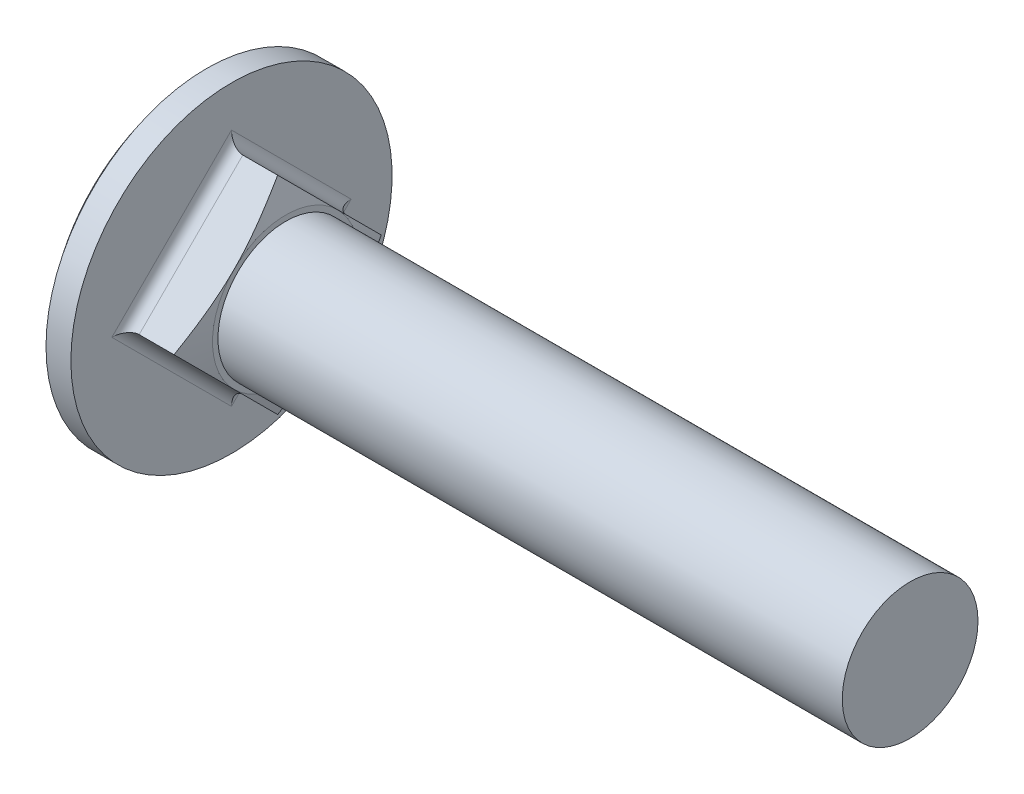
ISO-10303-21;
HEADER;
FILE_DESCRIPTION(('STEP AP214'),'2;1');
FILE_NAME('part.step','',(''),(''),'','','');
FILE_SCHEMA(('AUTOMOTIVE_DESIGN { 1 0 10303 214 1 1 1 1 }'));
ENDSEC;
DATA;
#1=APPLICATION_CONTEXT('core data for automotive mechanical design processes');
#2=APPLICATION_PROTOCOL_DEFINITION('international standard','automotive_design',2000,#1);
#3=PRODUCT_CONTEXT('',#1,'mechanical');
#4=PRODUCT('Part','Part','',(#3));
#5=PRODUCT_RELATED_PRODUCT_CATEGORY('part','',(#4));
#6=PRODUCT_DEFINITION_FORMATION('','',#4);
#7=PRODUCT_DEFINITION_CONTEXT('part definition',#1,'design');
#8=PRODUCT_DEFINITION('design','',#6,#7);
#9=PRODUCT_DEFINITION_SHAPE('','',#8);
#10=(LENGTH_UNIT() NAMED_UNIT(*) SI_UNIT(.MILLI.,.METRE.));
#11=(NAMED_UNIT(*) PLANE_ANGLE_UNIT() SI_UNIT($,.RADIAN.));
#12=(NAMED_UNIT(*) SI_UNIT($,.STERADIAN.) SOLID_ANGLE_UNIT());
#13=UNCERTAINTY_MEASURE_WITH_UNIT(LENGTH_MEASURE(1.E-05),#10,'distance_accuracy_value','');
#14=(GEOMETRIC_REPRESENTATION_CONTEXT(3) GLOBAL_UNCERTAINTY_ASSIGNED_CONTEXT((#13)) GLOBAL_UNIT_ASSIGNED_CONTEXT((#10,
#11,#12)) REPRESENTATION_CONTEXT('',''));
#15=CARTESIAN_POINT('',(0.,0.,0.));
#16=DIRECTION('',(0.,0.,1.));
#17=DIRECTION('',(1.,0.,0.));
#18=AXIS2_PLACEMENT_3D('',#15,#16,#17);
#19=CARTESIAN_POINT('',(6.,0.,-4.58205194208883));
#20=DIRECTION('',(1.,0.,0.));
#21=DIRECTION('',(0.,0.,-1.));
#22=AXIS2_PLACEMENT_3D('',#19,#20,#21);
#23=PLANE('',#22);
#24=CARTESIAN_POINT('',(6.,0.,0.));
#25=DIRECTION('',(1.,0.,0.));
#26=DIRECTION('',(0.,0.,-1.));
#27=AXIS2_PLACEMENT_3D('',#24,#25,#26);
#28=CIRCLE('',#27,3.24);
#29=CARTESIAN_POINT('',(6.,-2.29102597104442,-2.29102597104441));
#30=VERTEX_POINT('',#29);
#31=CARTESIAN_POINT('',(6.,2.29102597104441,-2.29102597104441));
#32=VERTEX_POINT('',#31);
#33=EDGE_CURVE('E128',#30,#32,#28,.T.);
#34=ORIENTED_EDGE('',*,*,#33,.T.);
#35=CARTESIAN_POINT('',(6.,0.,0.));
#36=DIRECTION('',(-1.,0.,0.));
#37=DIRECTION('',(0.,0.,1.));
#38=AXIS2_PLACEMENT_3D('',#35,#36,#37);
#39=CIRCLE('',#38,3.24);
#40=CARTESIAN_POINT('',(6.,2.29102597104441,2.29102597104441));
#41=VERTEX_POINT('',#40);
#42=EDGE_CURVE('E107',#41,#32,#39,.T.);
#43=ORIENTED_EDGE('',*,*,#42,.F.);
#44=CARTESIAN_POINT('',(6.,-2.29102597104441,2.29102597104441));
#45=VERTEX_POINT('',#44);
#46=EDGE_CURVE('E117',#41,#45,#28,.T.);
#47=ORIENTED_EDGE('',*,*,#46,.T.);
#48=EDGE_CURVE('E126',#45,#30,#28,.T.);
#49=ORIENTED_EDGE('',*,*,#48,.T.);
#50=EDGE_LOOP('',(#34,#43,#47,#49));
#51=FACE_BOUND('',#50,.T.);
#52=CARTESIAN_POINT('',(6.,0.,0.));
#53=DIRECTION('',(1.,0.,0.));
#54=DIRECTION('',(0.,0.,-1.));
#55=AXIS2_PLACEMENT_3D('',#52,#53,#54);
#56=CIRCLE('',#55,3.);
#57=CARTESIAN_POINT('',(6.,0.,-3.));
#58=VERTEX_POINT('',#57);
#59=EDGE_CURVE('E134',#58,#58,#56,.F.);
#60=ORIENTED_EDGE('',*,*,#59,.T.);
#61=EDGE_LOOP('',(#60));
#62=FACE_BOUND('',#61,.T.);
#63=ADVANCED_FACE('F37',(#51,#62),#23,.T.);
#64=CARTESIAN_POINT('',(6.,-4.58205194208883,0.));
#65=DIRECTION('',(0.,0.707106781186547,0.707106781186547));
#66=DIRECTION('',(0.,-0.707106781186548,0.707106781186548));
#67=AXIS2_PLACEMENT_3D('',#64,#65,#66);
#68=PLANE('',#67);
#69=DIRECTION('',(-1.,0.,0.));
#70=VECTOR('',#69,1.);
#71=CARTESIAN_POINT('',(6.,-4.58205194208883,0.));
#72=LINE('',#71,#70);
#73=CARTESIAN_POINT('',(5.64039826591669,-4.58205194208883,0.));
#74=VERTEX_POINT('',#73);
#75=CARTESIAN_POINT('',(4.1,-4.58205194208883,0.));
#76=VERTEX_POINT('',#75);
#77=EDGE_CURVE('E179',#74,#76,#72,.T.);
#78=ORIENTED_EDGE('',*,*,#77,.T.);
#79=DIRECTION('',(0.,0.707106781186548,-0.707106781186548));
#80=VECTOR('',#79,1.);
#81=CARTESIAN_POINT('',(4.1,0.,-4.58205194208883));
#82=LINE('',#81,#80);
#83=CARTESIAN_POINT('',(4.1,0.,-4.58205194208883));
#84=VERTEX_POINT('',#83);
#85=EDGE_CURVE('E360',#76,#84,#82,.T.);
#86=ORIENTED_EDGE('',*,*,#85,.T.);
#87=DIRECTION('',(-1.,0.,0.));
#88=VECTOR('',#87,1.);
#89=CARTESIAN_POINT('',(6.,0.,-4.58205194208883));
#90=LINE('',#89,#88);
#91=CARTESIAN_POINT('',(5.64039826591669,0.,-4.58205194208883));
#92=VERTEX_POINT('',#91);
#93=EDGE_CURVE('E379',#92,#84,#90,.T.);
#94=ORIENTED_EDGE('',*,*,#93,.F.);
#95=CARTESIAN_POINT('',(5.64034467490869,-4.58225194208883,0.000199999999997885));
#96=CARTESIAN_POINT('',(5.65876866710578,-4.5134869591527,-0.0685649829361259));
#97=CARTESIAN_POINT('',(5.67679709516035,-4.44466899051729,-0.137382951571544));
#98=CARTESIAN_POINT('',(5.71193086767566,-4.30691217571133,-0.275139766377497));
#99=CARTESIAN_POINT('',(5.72903616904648,-4.23797332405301,-0.344078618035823));
#100=CARTESIAN_POINT('',(5.77878786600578,-4.03087543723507,-0.55117650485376));
#101=CARTESIAN_POINT('',(5.80984641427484,-3.89252201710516,-0.689529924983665));
#102=CARTESIAN_POINT('',(5.86642222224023,-3.61508464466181,-0.966967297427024));
#103=CARTESIAN_POINT('',(5.89193331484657,-3.47600005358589,-1.10605188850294));
#104=CARTESIAN_POINT('',(5.93577986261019,-3.19728230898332,-1.38476963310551));
#105=CARTESIAN_POINT('',(5.95411685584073,-3.05764927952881,-1.52440266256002));
#106=CARTESIAN_POINT('',(5.98186834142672,-2.78005294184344,-1.80199900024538));
#107=CARTESIAN_POINT('',(5.99141376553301,-2.64209637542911,-1.93995556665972));
#108=CARTESIAN_POINT('',(6.00109635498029,-2.36601142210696,-2.21604051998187));
#109=CARTESIAN_POINT('',(6.00123347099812,-2.22788303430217,-2.35416890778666));
#110=CARTESIAN_POINT('',(5.99208895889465,-1.95192665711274,-2.63012528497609));
#111=CARTESIAN_POINT('',(5.98281676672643,-1.81409850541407,-2.76795343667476));
#112=CARTESIAN_POINT('',(5.95580247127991,-1.53886791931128,-3.04318402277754));
#113=CARTESIAN_POINT('',(5.93806025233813,-1.40146549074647,-3.18058645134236));
#114=CARTESIAN_POINT('',(5.90043611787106,-1.15865352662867,-3.42339841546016));
#115=CARTESIAN_POINT('',(5.8819769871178,-1.05313029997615,-3.52892164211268));
#116=CARTESIAN_POINT('',(5.84158913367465,-0.842407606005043,-3.73964433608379));
#117=CARTESIAN_POINT('',(5.8196600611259,-0.737208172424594,-3.84484376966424));
#118=CARTESIAN_POINT('',(5.77282586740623,-0.526454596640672,-4.05559734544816));
#119=CARTESIAN_POINT('',(5.74790259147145,-0.420902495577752,-4.16114944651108));
#120=CARTESIAN_POINT('',(5.69573380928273,-0.210124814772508,-4.37192712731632));
#121=CARTESIAN_POINT('',(5.6684891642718,-0.104899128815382,-4.47715281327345));
#122=CARTESIAN_POINT('',(5.64034467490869,0.0001999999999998,-4.58225194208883));
#123=B_SPLINE_CURVE_WITH_KNOTS('',3,(#95,#96,#97,#98,#99,#100,#101,#102,#103,#104,#105,#106,
#107,#108,#109,#110,#111,#112,#113,#114,#115,#116,#117,#118,#119,#120,#121,#122),.UNSPECIFIED.,
.F.,.F.,(4,2,2,2,2,2,2,2,2,2,2,2,2,4),(0.,0.296933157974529,0.593880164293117,1.18814974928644,
1.78307664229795,2.37787591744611,2.96366649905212,3.5494601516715,4.1346669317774,
4.71988170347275,5.17094698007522,5.62205776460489,6.07605670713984,6.52988794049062),.UNSPECIFIED.);
#124=EDGE_CURVE('E170',#30,#92,#123,.T.);
#125=ORIENTED_EDGE('',*,*,#124,.F.);
#126=EDGE_CURVE('E177',#74,#30,#123,.T.);
#127=ORIENTED_EDGE('',*,*,#126,.F.);
#128=EDGE_LOOP('',(#78,#86,#94,#125,#127));
#129=FACE_BOUND('',#128,.T.);
#130=ADVANCED_FACE('F181',(#129),#68,.F.);
#131=CARTESIAN_POINT('',(6.,0.,-4.58205194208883));
#132=DIRECTION('',(0.,-0.707106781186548,0.707106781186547));
#133=DIRECTION('',(0.,-0.707106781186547,-0.707106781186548));
#134=AXIS2_PLACEMENT_3D('',#131,#132,#133);
#135=PLANE('',#134);
#136=ORIENTED_EDGE('',*,*,#93,.T.);
#137=DIRECTION('',(0.,0.707106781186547,0.707106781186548));
#138=VECTOR('',#137,1.);
#139=CARTESIAN_POINT('',(4.1,4.58205194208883,0.));
#140=LINE('',#139,#138);
#141=CARTESIAN_POINT('',(4.1,4.58205194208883,0.));
#142=VERTEX_POINT('',#141);
#143=EDGE_CURVE('E125',#84,#142,#140,.T.);
#144=ORIENTED_EDGE('',*,*,#143,.T.);
#145=DIRECTION('',(-1.,0.,0.));
#146=VECTOR('',#145,1.);
#147=CARTESIAN_POINT('',(6.,4.58205194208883,0.));
#148=LINE('',#147,#146);
#149=CARTESIAN_POINT('',(5.64039826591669,4.58205194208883,0.));
#150=VERTEX_POINT('',#149);
#151=EDGE_CURVE('E382',#150,#142,#148,.T.);
#152=ORIENTED_EDGE('',*,*,#151,.F.);
#153=CARTESIAN_POINT('',(5.64034467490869,-0.000199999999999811,-4.58225194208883));
#154=CARTESIAN_POINT('',(5.65876866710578,0.0685649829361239,-4.51348695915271));
#155=CARTESIAN_POINT('',(5.67679709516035,0.137382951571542,-4.44466899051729));
#156=CARTESIAN_POINT('',(5.71193086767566,0.275139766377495,-4.30691217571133));
#157=CARTESIAN_POINT('',(5.72903616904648,0.344078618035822,-4.23797332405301));
#158=CARTESIAN_POINT('',(5.77878786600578,0.551176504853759,-4.03087543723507));
#159=CARTESIAN_POINT('',(5.80984641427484,0.689529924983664,-3.89252201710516));
#160=CARTESIAN_POINT('',(5.86642222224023,0.966967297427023,-3.61508464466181));
#161=CARTESIAN_POINT('',(5.89193331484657,1.10605188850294,-3.47600005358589));
#162=CARTESIAN_POINT('',(5.93577986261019,1.38476963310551,-3.19728230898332));
#163=CARTESIAN_POINT('',(5.95411685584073,1.52440266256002,-3.05764927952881));
#164=CARTESIAN_POINT('',(5.98186834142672,1.80199900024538,-2.78005294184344));
#165=CARTESIAN_POINT('',(5.99141376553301,1.93995556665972,-2.64209637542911));
#166=CARTESIAN_POINT('',(6.00109635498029,2.21604051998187,-2.36601142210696));
#167=CARTESIAN_POINT('',(6.00123347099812,2.35416890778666,-2.22788303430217));
#168=CARTESIAN_POINT('',(5.99208895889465,2.63012528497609,-1.95192665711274));
#169=CARTESIAN_POINT('',(5.98281676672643,2.76795343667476,-1.81409850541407));
#170=CARTESIAN_POINT('',(5.95580247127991,3.04318402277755,-1.53886791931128));
#171=CARTESIAN_POINT('',(5.93806025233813,3.18058645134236,-1.40146549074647));
#172=CARTESIAN_POINT('',(5.90043611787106,3.42339841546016,-1.15865352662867));
#173=CARTESIAN_POINT('',(5.8819769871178,3.52892164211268,-1.05313029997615));
#174=CARTESIAN_POINT('',(5.84158913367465,3.73964433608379,-0.842407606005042));
#175=CARTESIAN_POINT('',(5.8196600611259,3.84484376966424,-0.737208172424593));
#176=CARTESIAN_POINT('',(5.77282586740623,4.05559734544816,-0.526454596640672));
#177=CARTESIAN_POINT('',(5.74790259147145,4.16114944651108,-0.420902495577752));
#178=CARTESIAN_POINT('',(5.69573380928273,4.37192712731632,-0.210124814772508));
#179=CARTESIAN_POINT('',(5.6684891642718,4.47715281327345,-0.104899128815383));
#180=CARTESIAN_POINT('',(5.64034467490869,4.58225194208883,0.000199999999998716));
#181=B_SPLINE_CURVE_WITH_KNOTS('',3,(#153,#154,#155,#156,#157,#158,#159,#160,#161,#162,#163,
#164,#165,#166,#167,#168,#169,#170,#171,#172,#173,#174,#175,#176,#177,#178,#179,#180),
.UNSPECIFIED.,.F.,.F.,(4,2,2,2,2,2,2,2,2,2,2,2,2,4),(0.,0.29693315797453,0.593880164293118,
1.18814974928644,1.78307664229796,2.37787591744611,2.96366649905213,3.54946015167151,
4.13466693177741,4.71988170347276,5.17094698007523,5.6220577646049,6.07605670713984,
6.52988794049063),.UNSPECIFIED.);
#182=EDGE_CURVE('E110',#32,#150,#181,.T.);
#183=ORIENTED_EDGE('',*,*,#182,.F.);
#184=EDGE_CURVE('E178',#92,#32,#181,.T.);
#185=ORIENTED_EDGE('',*,*,#184,.F.);
#186=EDGE_LOOP('',(#136,#144,#152,#183,#185));
#187=FACE_BOUND('',#186,.T.);
#188=ADVANCED_FACE('F185',(#187),#135,.F.);
#189=CARTESIAN_POINT('',(6.,4.58205194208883,0.));
#190=DIRECTION('',(0.,-0.707106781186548,-0.707106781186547));
#191=DIRECTION('',(0.,0.707106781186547,-0.707106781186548));
#192=AXIS2_PLACEMENT_3D('',#189,#190,#191);
#193=PLANE('',#192);
#194=ORIENTED_EDGE('',*,*,#151,.T.);
#195=DIRECTION('',(0.,-0.707106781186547,0.707106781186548));
#196=VECTOR('',#195,1.);
#197=CARTESIAN_POINT('',(4.1,0.,4.58205194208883));
#198=LINE('',#197,#196);
#199=CARTESIAN_POINT('',(4.1,0.,4.58205194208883));
#200=VERTEX_POINT('',#199);
#201=EDGE_CURVE('E11',#142,#200,#198,.T.);
#202=ORIENTED_EDGE('',*,*,#201,.T.);
#203=DIRECTION('',(-1.,0.,0.));
#204=VECTOR('',#203,1.);
#205=CARTESIAN_POINT('',(6.,0.,4.58205194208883));
#206=LINE('',#205,#204);
#207=CARTESIAN_POINT('',(5.64039826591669,0.,4.58205194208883));
#208=VERTEX_POINT('',#207);
#209=EDGE_CURVE('E137',#208,#200,#206,.T.);
#210=ORIENTED_EDGE('',*,*,#209,.F.);
#211=CARTESIAN_POINT('',(5.64034467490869,4.58225194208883,-0.000200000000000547));
#212=CARTESIAN_POINT('',(5.65876866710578,4.5134869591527,0.0685649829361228));
#213=CARTESIAN_POINT('',(5.67679709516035,4.44466899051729,0.137382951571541));
#214=CARTESIAN_POINT('',(5.71193086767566,4.30691217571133,0.275139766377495));
#215=CARTESIAN_POINT('',(5.72903616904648,4.23797332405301,0.344078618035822));
#216=CARTESIAN_POINT('',(5.77878786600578,4.03087543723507,0.551176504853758));
#217=CARTESIAN_POINT('',(5.80984641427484,3.89252201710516,0.689529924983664));
#218=CARTESIAN_POINT('',(5.86642222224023,3.61508464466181,0.966967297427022));
#219=CARTESIAN_POINT('',(5.89193331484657,3.47600005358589,1.10605188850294));
#220=CARTESIAN_POINT('',(5.93577986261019,3.19728230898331,1.38476963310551));
#221=CARTESIAN_POINT('',(5.95411685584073,3.05764927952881,1.52440266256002));
#222=CARTESIAN_POINT('',(5.98186834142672,2.78005294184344,1.80199900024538));
#223=CARTESIAN_POINT('',(5.99141376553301,2.6420963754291,1.93995556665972));
#224=CARTESIAN_POINT('',(6.00109635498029,2.36601142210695,2.21604051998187));
#225=CARTESIAN_POINT('',(6.00123347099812,2.22788303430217,2.35416890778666));
#226=CARTESIAN_POINT('',(5.99208895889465,1.95192665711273,2.63012528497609));
#227=CARTESIAN_POINT('',(5.98281676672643,1.81409850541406,2.76795343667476));
#228=CARTESIAN_POINT('',(5.95580247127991,1.53886791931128,3.04318402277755));
#229=CARTESIAN_POINT('',(5.93806025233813,1.40146549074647,3.18058645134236));
#230=CARTESIAN_POINT('',(5.90043611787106,1.15865352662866,3.42339841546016));
#231=CARTESIAN_POINT('',(5.8819769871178,1.05313029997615,3.52892164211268));
#232=CARTESIAN_POINT('',(5.84158913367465,0.842407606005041,3.73964433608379));
#233=CARTESIAN_POINT('',(5.8196600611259,0.737208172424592,3.84484376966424));
#234=CARTESIAN_POINT('',(5.77282586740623,0.526454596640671,4.05559734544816));
#235=CARTESIAN_POINT('',(5.74790259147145,0.420902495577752,4.16114944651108));
#236=CARTESIAN_POINT('',(5.69573380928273,0.210124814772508,4.37192712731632));
#237=CARTESIAN_POINT('',(5.6684891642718,0.104899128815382,4.47715281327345));
#238=CARTESIAN_POINT('',(5.64034467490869,-0.000199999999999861,4.58225194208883));
#239=B_SPLINE_CURVE_WITH_KNOTS('',3,(#211,#212,#213,#214,#215,#216,#217,#218,#219,#220,#221,
#222,#223,#224,#225,#226,#227,#228,#229,#230,#231,#232,#233,#234,#235,#236,#237,#238),
.UNSPECIFIED.,.F.,.F.,(4,2,2,2,2,2,2,2,2,2,2,2,2,4),(0.,0.29693315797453,0.593880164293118,
1.18814974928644,1.78307664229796,2.37787591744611,2.96366649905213,3.54946015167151,
4.13466693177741,4.71988170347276,5.17094698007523,5.6220577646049,6.07605670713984,
6.52988794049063),.UNSPECIFIED.);
#240=EDGE_CURVE('E113',#41,#208,#239,.T.);
#241=ORIENTED_EDGE('',*,*,#240,.F.);
#242=EDGE_CURVE('E103',#150,#41,#239,.T.);
#243=ORIENTED_EDGE('',*,*,#242,.F.);
#244=EDGE_LOOP('',(#194,#202,#210,#241,#243));
#245=FACE_BOUND('',#244,.T.);
#246=ADVANCED_FACE('F136',(#245),#193,.F.);
#247=CARTESIAN_POINT('',(6.,0.,4.58205194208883));
#248=DIRECTION('',(0.,0.707106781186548,-0.707106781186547));
#249=DIRECTION('',(0.,0.707106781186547,0.707106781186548));
#250=AXIS2_PLACEMENT_3D('',#247,#248,#249);
#251=PLANE('',#250);
#252=ORIENTED_EDGE('',*,*,#209,.T.);
#253=DIRECTION('',(0.,-0.707106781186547,-0.707106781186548));
#254=VECTOR('',#253,1.);
#255=CARTESIAN_POINT('',(4.1,-4.58205194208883,0.));
#256=LINE('',#255,#254);
#257=EDGE_CURVE('E46',#200,#76,#256,.T.);
#258=ORIENTED_EDGE('',*,*,#257,.T.);
#259=ORIENTED_EDGE('',*,*,#77,.F.);
#260=CARTESIAN_POINT('',(5.64034467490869,0.000199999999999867,4.58225194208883));
#261=CARTESIAN_POINT('',(5.65876866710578,-0.0685649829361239,4.51348695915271));
#262=CARTESIAN_POINT('',(5.67679709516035,-0.137382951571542,4.44466899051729));
#263=CARTESIAN_POINT('',(5.71193086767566,-0.275139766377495,4.30691217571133));
#264=CARTESIAN_POINT('',(5.72903616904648,-0.344078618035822,4.23797332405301));
#265=CARTESIAN_POINT('',(5.77878786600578,-0.551176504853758,4.03087543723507));
#266=CARTESIAN_POINT('',(5.80984641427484,-0.689529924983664,3.89252201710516));
#267=CARTESIAN_POINT('',(5.86642222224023,-0.966967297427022,3.61508464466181));
#268=CARTESIAN_POINT('',(5.89193331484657,-1.10605188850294,3.47600005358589));
#269=CARTESIAN_POINT('',(5.93577986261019,-1.38476963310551,3.19728230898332));
#270=CARTESIAN_POINT('',(5.95411685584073,-1.52440266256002,3.05764927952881));
#271=CARTESIAN_POINT('',(5.98186834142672,-1.80199900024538,2.78005294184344));
#272=CARTESIAN_POINT('',(5.99141376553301,-1.93995556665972,2.6420963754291));
#273=CARTESIAN_POINT('',(6.00109635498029,-2.21604051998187,2.36601142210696));
#274=CARTESIAN_POINT('',(6.00123347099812,-2.35416890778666,2.22788303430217));
#275=CARTESIAN_POINT('',(5.99208895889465,-2.63012528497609,1.95192665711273));
#276=CARTESIAN_POINT('',(5.98281676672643,-2.76795343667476,1.81409850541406));
#277=CARTESIAN_POINT('',(5.95580247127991,-3.04318402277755,1.53886791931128));
#278=CARTESIAN_POINT('',(5.93806025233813,-3.18058645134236,1.40146549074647));
#279=CARTESIAN_POINT('',(5.90043611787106,-3.42339841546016,1.15865352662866));
#280=CARTESIAN_POINT('',(5.8819769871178,-3.52892164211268,1.05313029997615));
#281=CARTESIAN_POINT('',(5.84158913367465,-3.73964433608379,0.84240760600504));
#282=CARTESIAN_POINT('',(5.8196600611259,-3.84484376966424,0.737208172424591));
#283=CARTESIAN_POINT('',(5.77282586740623,-4.05559734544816,0.52645459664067));
#284=CARTESIAN_POINT('',(5.74790259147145,-4.16114944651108,0.42090249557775));
#285=CARTESIAN_POINT('',(5.69573380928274,-4.37192712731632,0.210124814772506));
#286=CARTESIAN_POINT('',(5.6684891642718,-4.47715281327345,0.10489912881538));
#287=CARTESIAN_POINT('',(5.64034467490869,-4.58225194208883,-0.00020000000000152));
#288=B_SPLINE_CURVE_WITH_KNOTS('',3,(#260,#261,#262,#263,#264,#265,#266,#267,#268,#269,#270,
#271,#272,#273,#274,#275,#276,#277,#278,#279,#280,#281,#282,#283,#284,#285,#286,#287),
.UNSPECIFIED.,.F.,.F.,(4,2,2,2,2,2,2,2,2,2,2,2,2,4),(0.,0.29693315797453,0.593880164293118,
1.18814974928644,1.78307664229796,2.37787591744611,2.96366649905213,3.54946015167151,
4.13466693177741,4.71988170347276,5.17094698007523,5.6220577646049,6.07605670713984,
6.52988794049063),.UNSPECIFIED.);
#289=EDGE_CURVE('E133',#45,#74,#288,.T.);
#290=ORIENTED_EDGE('',*,*,#289,.F.);
#291=EDGE_CURVE('E120',#208,#45,#288,.T.);
#292=ORIENTED_EDGE('',*,*,#291,.F.);
#293=EDGE_LOOP('',(#252,#258,#259,#290,#292));
#294=FACE_BOUND('',#293,.T.);
#295=ADVANCED_FACE('F199',(#294),#251,.F.);
#296=CARTESIAN_POINT('',(3.6,0.,0.));
#297=DIRECTION('',(-1.,0.,0.));
#298=DIRECTION('',(0.,0.,1.));
#299=AXIS2_PLACEMENT_3D('',#296,#297,#298);
#300=PLANE('',#299);
#301=DIRECTION('',(0.,-0.707106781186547,0.707106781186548));
#302=VECTOR('',#301,1.);
#303=CARTESIAN_POINT('',(3.6,4.9356053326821,0.353553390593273));
#304=LINE('',#303,#302);
#305=CARTESIAN_POINT('',(3.6,0.,5.28915872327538));
#306=VERTEX_POINT('',#305);
#307=CARTESIAN_POINT('',(3.6,5.28915872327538,0.));
#308=VERTEX_POINT('',#307);
#309=EDGE_CURVE('E369',#306,#308,#304,.F.);
#310=ORIENTED_EDGE('',*,*,#309,.T.);
#311=DIRECTION('',(0.,0.707106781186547,0.707106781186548));
#312=VECTOR('',#311,1.);
#313=CARTESIAN_POINT('',(3.6,0.353553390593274,-4.9356053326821));
#314=LINE('',#313,#312);
#315=CARTESIAN_POINT('',(3.6,0.,-5.28915872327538));
#316=VERTEX_POINT('',#315);
#317=EDGE_CURVE('E362',#308,#316,#314,.F.);
#318=ORIENTED_EDGE('',*,*,#317,.T.);
#319=DIRECTION('',(0.,0.707106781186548,-0.707106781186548));
#320=VECTOR('',#319,1.);
#321=CARTESIAN_POINT('',(3.6,-4.9356053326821,-0.353553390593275));
#322=LINE('',#321,#320);
#323=CARTESIAN_POINT('',(3.6,-5.28915872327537,0.));
#324=VERTEX_POINT('',#323);
#325=EDGE_CURVE('E365',#316,#324,#322,.F.);
#326=ORIENTED_EDGE('',*,*,#325,.T.);
#327=DIRECTION('',(0.,-0.707106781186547,-0.707106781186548));
#328=VECTOR('',#327,1.);
#329=CARTESIAN_POINT('',(3.6,-0.353553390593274,4.9356053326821));
#330=LINE('',#329,#328);
#331=EDGE_CURVE('E367',#324,#306,#330,.F.);
#332=ORIENTED_EDGE('',*,*,#331,.T.);
#333=EDGE_LOOP('',(#310,#318,#326,#332));
#334=FACE_BOUND('',#333,.T.);
#335=CARTESIAN_POINT('',(3.6,0.,0.));
#336=DIRECTION('',(-1.,0.,0.));
#337=DIRECTION('',(0.,0.,1.));
#338=AXIS2_PLACEMENT_3D('',#335,#336,#337);
#339=CIRCLE('',#338,7.1);
#340=CARTESIAN_POINT('',(3.6,0.,7.1));
#341=VERTEX_POINT('',#340);
#342=EDGE_CURVE('E373',#341,#341,#339,.T.);
#343=ORIENTED_EDGE('',*,*,#342,.F.);
#344=EDGE_LOOP('',(#343));
#345=FACE_BOUND('',#344,.T.);
#346=ADVANCED_FACE('F195',(#334,#345),#300,.F.);
#347=CARTESIAN_POINT('',(-6.26682124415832,0.,0.));
#348=DIRECTION('',(-1.,0.,0.));
#349=DIRECTION('',(0.,0.,1.));
#350=AXIS2_PLACEMENT_3D('',#347,#348,#349);
#351=CYLINDRICAL_SURFACE('',#350,7.1);
#352=CARTESIAN_POINT('',(2.5,0.,0.));
#353=DIRECTION('',(-1.,0.,0.));
#354=DIRECTION('',(0.,0.,1.));
#355=AXIS2_PLACEMENT_3D('',#352,#353,#354);
#356=CIRCLE('',#355,7.1);
#357=CARTESIAN_POINT('',(2.5,0.,7.1));
#358=VERTEX_POINT('',#357);
#359=EDGE_CURVE('E376',#358,#358,#356,.T.);
#360=ORIENTED_EDGE('',*,*,#359,.F.);
#361=EDGE_LOOP('',(#360));
#362=FACE_BOUND('',#361,.T.);
#363=ORIENTED_EDGE('',*,*,#342,.T.);
#364=EDGE_LOOP('',(#363));
#365=FACE_BOUND('',#364,.T.);
#366=ADVANCED_FACE('F191',(#362,#365),#351,.T.);
#367=CARTESIAN_POINT('',(11.332,0.,0.));
#368=DIRECTION('',(-1.,0.,0.));
#369=DIRECTION('',(0.,1.,0.));
#370=AXIS2_PLACEMENT_3D('',#367,#368,#369);
#371=SPHERICAL_SURFACE('',#370,11.332);
#372=ORIENTED_EDGE('',*,*,#359,.T.);
#373=EDGE_LOOP('',(#372));
#374=FACE_BOUND('',#373,.T.);
#375=ADVANCED_FACE('F188',(#374),#371,.T.);
#376=CARTESIAN_POINT('',(5.64039826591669,0.,0.));
#377=DIRECTION('',(-1.,0.,0.));
#378=DIRECTION('',(0.,0.,1.));
#379=AXIS2_PLACEMENT_3D('',#376,#377,#378);
#380=CONICAL_SURFACE('',#379,4.58205194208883,1.30899693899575);
#381=ORIENTED_EDGE('',*,*,#124,.T.);
#382=ORIENTED_EDGE('',*,*,#184,.T.);
#383=ORIENTED_EDGE('',*,*,#33,.F.);
#384=EDGE_LOOP('',(#381,#382,#383));
#385=FACE_BOUND('',#384,.T.);
#386=ADVANCED_FACE('F163',(#385),#380,.T.);
#387=ORIENTED_EDGE('',*,*,#126,.T.);
#388=ORIENTED_EDGE('',*,*,#48,.F.);
#389=ORIENTED_EDGE('',*,*,#289,.T.);
#390=EDGE_LOOP('',(#387,#388,#389));
#391=FACE_BOUND('',#390,.T.);
#392=ADVANCED_FACE('F158',(#391),#380,.T.);
#393=ORIENTED_EDGE('',*,*,#240,.T.);
#394=ORIENTED_EDGE('',*,*,#291,.T.);
#395=ORIENTED_EDGE('',*,*,#46,.F.);
#396=EDGE_LOOP('',(#393,#394,#395));
#397=FACE_BOUND('',#396,.T.);
#398=ADVANCED_FACE('F118',(#397),#380,.T.);
#399=ORIENTED_EDGE('',*,*,#182,.T.);
#400=ORIENTED_EDGE('',*,*,#242,.T.);
#401=ORIENTED_EDGE('',*,*,#42,.T.);
#402=EDGE_LOOP('',(#399,#400,#401));
#403=FACE_BOUND('',#402,.T.);
#404=ADVANCED_FACE('F105',(#403),#380,.T.);
#405=CARTESIAN_POINT('',(33.6,0.,0.));
#406=DIRECTION('',(-1.,0.,0.));
#407=DIRECTION('',(0.,0.,1.));
#408=AXIS2_PLACEMENT_3D('',#405,#406,#407);
#409=CYLINDRICAL_SURFACE('',#408,3.);
#410=ORIENTED_EDGE('',*,*,#59,.F.);
#411=EDGE_LOOP('',(#410));
#412=FACE_BOUND('',#411,.T.);
#413=CARTESIAN_POINT('',(33.6,0.,0.));
#414=DIRECTION('',(1.,0.,0.));
#415=DIRECTION('',(0.,0.,-1.));
#416=AXIS2_PLACEMENT_3D('',#413,#414,#415);
#417=CIRCLE('',#416,3.);
#418=CARTESIAN_POINT('',(33.6,0.,-3.));
#419=VERTEX_POINT('',#418);
#420=EDGE_CURVE('E342',#419,#419,#417,.T.);
#421=ORIENTED_EDGE('',*,*,#420,.F.);
#422=EDGE_LOOP('',(#421));
#423=FACE_BOUND('',#422,.T.);
#424=ADVANCED_FACE('F165',(#412,#423),#409,.T.);
#425=CARTESIAN_POINT('',(33.6,0.,0.));
#426=DIRECTION('',(1.,0.,0.));
#427=DIRECTION('',(0.,0.,-1.));
#428=AXIS2_PLACEMENT_3D('',#425,#426,#427);
#429=PLANE('',#428);
#430=ORIENTED_EDGE('',*,*,#420,.T.);
#431=EDGE_LOOP('',(#430));
#432=FACE_BOUND('',#431,.T.);
#433=ADVANCED_FACE('F214',(#432),#429,.T.);
#434=CARTESIAN_POINT('',(4.1,-0.353553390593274,4.9356053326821));
#435=DIRECTION('',(0.,0.707106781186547,0.707106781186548));
#436=DIRECTION('',(0.,-0.707106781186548,0.707106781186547));
#437=AXIS2_PLACEMENT_3D('',#434,#435,#436);
#438=CYLINDRICAL_SURFACE('',#437,0.5);
#439=CARTESIAN_POINT('',(4.1,0.,5.28915872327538));
#440=DIRECTION('',(0.,1.,0.));
#441=DIRECTION('',(0.,0.,-1.));
#442=AXIS2_PLACEMENT_3D('',#439,#440,#441);
#443=ELLIPSE('',#442,0.707106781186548,0.5);
#444=EDGE_CURVE('E347',#306,#200,#443,.F.);
#445=ORIENTED_EDGE('',*,*,#444,.F.);
#446=ORIENTED_EDGE('',*,*,#331,.F.);
#447=CARTESIAN_POINT('',(4.1,-5.28915872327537,0.));
#448=DIRECTION('',(0.,0.,1.));
#449=DIRECTION('',(0.,1.,0.));
#450=AXIS2_PLACEMENT_3D('',#447,#448,#449);
#451=ELLIPSE('',#450,0.707106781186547,0.5);
#452=EDGE_CURVE('E41',#76,#324,#451,.T.);
#453=ORIENTED_EDGE('',*,*,#452,.F.);
#454=ORIENTED_EDGE('',*,*,#257,.F.);
#455=EDGE_LOOP('',(#445,#446,#453,#454));
#456=FACE_BOUND('',#455,.T.);
#457=ADVANCED_FACE('F39',(#456),#438,.F.);
#458=CARTESIAN_POINT('',(4.1,-4.9356053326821,-0.353553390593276));
#459=DIRECTION('',(0.,-0.707106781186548,0.707106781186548));
#460=DIRECTION('',(0.,-0.707106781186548,-0.707106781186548));
#461=AXIS2_PLACEMENT_3D('',#458,#459,#460);
#462=CYLINDRICAL_SURFACE('',#461,0.5);
#463=ORIENTED_EDGE('',*,*,#452,.T.);
#464=ORIENTED_EDGE('',*,*,#325,.F.);
#465=CARTESIAN_POINT('',(4.1,0.,-5.28915872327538));
#466=DIRECTION('',(0.,-1.,0.));
#467=DIRECTION('',(0.,0.,1.));
#468=AXIS2_PLACEMENT_3D('',#465,#466,#467);
#469=ELLIPSE('',#468,0.707106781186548,0.5);
#470=EDGE_CURVE('E352',#84,#316,#469,.T.);
#471=ORIENTED_EDGE('',*,*,#470,.F.);
#472=ORIENTED_EDGE('',*,*,#85,.F.);
#473=EDGE_LOOP('',(#463,#464,#471,#472));
#474=FACE_BOUND('',#473,.T.);
#475=ADVANCED_FACE('F207',(#474),#462,.F.);
#476=CARTESIAN_POINT('',(4.1,4.9356053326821,0.353553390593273));
#477=DIRECTION('',(0.,0.707106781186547,-0.707106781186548));
#478=DIRECTION('',(0.,0.707106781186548,0.707106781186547));
#479=AXIS2_PLACEMENT_3D('',#476,#477,#478);
#480=CYLINDRICAL_SURFACE('',#479,0.5);
#481=ORIENTED_EDGE('',*,*,#444,.T.);
#482=ORIENTED_EDGE('',*,*,#201,.F.);
#483=CARTESIAN_POINT('',(4.1,5.28915872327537,0.));
#484=DIRECTION('',(0.,0.,-1.));
#485=DIRECTION('',(0.,1.,0.));
#486=AXIS2_PLACEMENT_3D('',#483,#484,#485);
#487=ELLIPSE('',#486,0.707106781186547,0.5);
#488=EDGE_CURVE('E355',#308,#142,#487,.F.);
#489=ORIENTED_EDGE('',*,*,#488,.F.);
#490=ORIENTED_EDGE('',*,*,#309,.F.);
#491=EDGE_LOOP('',(#481,#482,#489,#490));
#492=FACE_BOUND('',#491,.T.);
#493=ADVANCED_FACE('F204',(#492),#480,.F.);
#494=CARTESIAN_POINT('',(4.1,0.353553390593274,-4.9356053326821));
#495=DIRECTION('',(0.,-0.707106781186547,-0.707106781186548));
#496=DIRECTION('',(0.,0.707106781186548,-0.707106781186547));
#497=AXIS2_PLACEMENT_3D('',#494,#495,#496);
#498=CYLINDRICAL_SURFACE('',#497,0.5);
#499=ORIENTED_EDGE('',*,*,#470,.T.);
#500=ORIENTED_EDGE('',*,*,#317,.F.);
#501=ORIENTED_EDGE('',*,*,#488,.T.);
#502=ORIENTED_EDGE('',*,*,#143,.F.);
#503=EDGE_LOOP('',(#499,#500,#501,#502));
#504=FACE_BOUND('',#503,.T.);
#505=ADVANCED_FACE('F201',(#504),#498,.F.);
#506=CLOSED_SHELL('',(#63,#130,#188,#246,#295,#346,#366,#375,#386,#392,#398,#404,#424,#433,#457,
#475,#493,#505));
#507=MANIFOLD_SOLID_BREP('B2',#506);
#508=ADVANCED_BREP_SHAPE_REPRESENTATION('',(#18,#507),#14);
#509=SHAPE_DEFINITION_REPRESENTATION(#9,#508);
ENDSEC;
END-ISO-10303-21;
